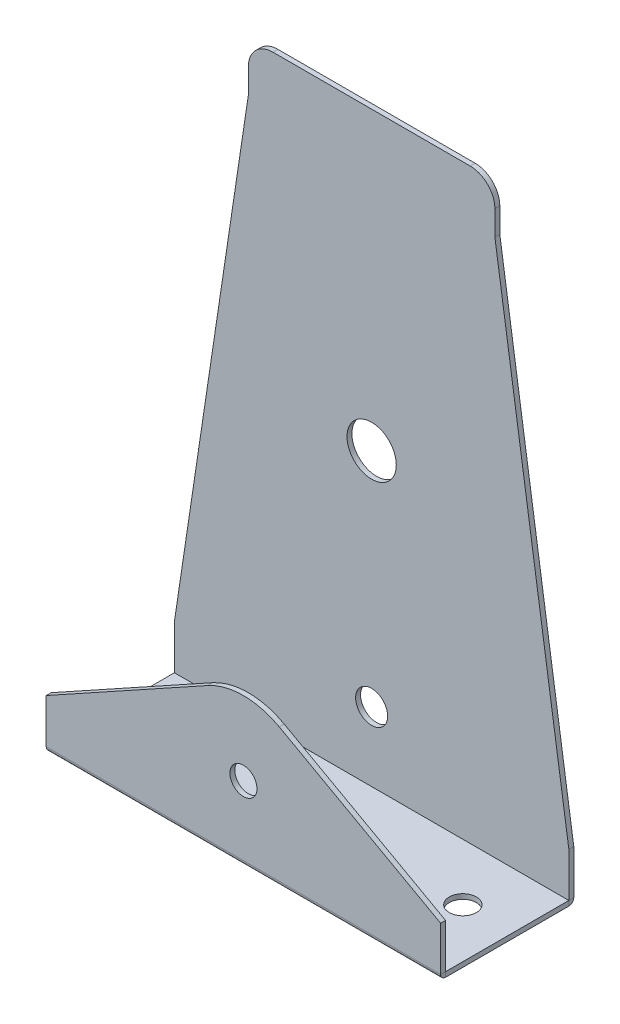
ISO-10303-21;
HEADER;
FILE_DESCRIPTION(('STEP AP214'),'2;1');
FILE_NAME('part.step','',(''),(''),'','','');
FILE_SCHEMA(('AUTOMOTIVE_DESIGN { 1 0 10303 214 1 1 1 1 }'));
ENDSEC;
DATA;
#1=APPLICATION_CONTEXT('core data for automotive mechanical design processes');
#2=APPLICATION_PROTOCOL_DEFINITION('international standard','automotive_design',2000,#1);
#3=PRODUCT_CONTEXT('',#1,'mechanical');
#4=PRODUCT('Part','Part','',(#3));
#5=PRODUCT_RELATED_PRODUCT_CATEGORY('part','',(#4));
#6=PRODUCT_DEFINITION_FORMATION('','',#4);
#7=PRODUCT_DEFINITION_CONTEXT('part definition',#1,'design');
#8=PRODUCT_DEFINITION('design','',#6,#7);
#9=PRODUCT_DEFINITION_SHAPE('','',#8);
#10=(LENGTH_UNIT() NAMED_UNIT(*) SI_UNIT(.MILLI.,.METRE.));
#11=(NAMED_UNIT(*) PLANE_ANGLE_UNIT() SI_UNIT($,.RADIAN.));
#12=(NAMED_UNIT(*) SI_UNIT($,.STERADIAN.) SOLID_ANGLE_UNIT());
#13=UNCERTAINTY_MEASURE_WITH_UNIT(LENGTH_MEASURE(1.E-05),#10,'distance_accuracy_value','');
#14=(GEOMETRIC_REPRESENTATION_CONTEXT(3) GLOBAL_UNCERTAINTY_ASSIGNED_CONTEXT((#13)) GLOBAL_UNIT_ASSIGNED_CONTEXT((#10,
#11,#12)) REPRESENTATION_CONTEXT('',''));
#15=CARTESIAN_POINT('',(0.,0.,0.));
#16=DIRECTION('',(0.,0.,1.));
#17=DIRECTION('',(1.,0.,0.));
#18=AXIS2_PLACEMENT_3D('',#15,#16,#17);
#19=CARTESIAN_POINT('',(-40.,39.0000000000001,35.0000272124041));
#20=DIRECTION('',(1.,0.,0.));
#21=DIRECTION('',(0.,-1.,0.));
#22=AXIS2_PLACEMENT_3D('',#19,#20,#21);
#23=PLANE('',#22);
#24=DIRECTION('',(0.,0.,1.));
#25=VECTOR('',#24,1.);
#26=CARTESIAN_POINT('',(-40.,39.0000000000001,35.0000272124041));
#27=LINE('',#26,#25);
#28=CARTESIAN_POINT('',(-40.,39.,1.0001));
#29=VERTEX_POINT('',#28);
#30=CARTESIAN_POINT('',(-40.,39.0000000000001,25.9999272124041));
#31=VERTEX_POINT('',#30);
#32=EDGE_CURVE('E43',#29,#31,#27,.T.);
#33=ORIENTED_EDGE('',*,*,#32,.F.);
#34=DIRECTION('',(0.,-1.,0.));
#35=VECTOR('',#34,1.);
#36=CARTESIAN_POINT('',(-40.,39.0000000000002,1.0001));
#37=LINE('',#36,#35);
#38=CARTESIAN_POINT('',(-40.,38.,1.0001));
#39=VERTEX_POINT('',#38);
#40=EDGE_CURVE('E12',#29,#39,#37,.T.);
#41=ORIENTED_EDGE('',*,*,#40,.T.);
#42=DIRECTION('',(0.,0.,1.));
#43=VECTOR('',#42,1.);
#44=CARTESIAN_POINT('',(-40.,38.0000000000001,35.0000272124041));
#45=LINE('',#44,#43);
#46=CARTESIAN_POINT('',(-40.,38.0000000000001,25.9999272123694));
#47=VERTEX_POINT('',#46);
#48=EDGE_CURVE('E56',#39,#47,#45,.T.);
#49=ORIENTED_EDGE('',*,*,#48,.T.);
#50=DIRECTION('',(0.,1.,0.));
#51=VECTOR('',#50,1.);
#52=CARTESIAN_POINT('',(-40.,39.0000000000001,25.9999272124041));
#53=LINE('',#52,#51);
#54=EDGE_CURVE('E376',#47,#31,#53,.T.);
#55=ORIENTED_EDGE('',*,*,#54,.T.);
#56=EDGE_LOOP('',(#33,#41,#49,#55));
#57=FACE_BOUND('',#56,.T.);
#58=ADVANCED_FACE('F40',(#57),#23,.F.);
#59=CARTESIAN_POINT('',(40.,39.0000000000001,35.0000272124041));
#60=DIRECTION('',(-1.,0.,0.));
#61=DIRECTION('',(0.,1.,0.));
#62=AXIS2_PLACEMENT_3D('',#59,#60,#61);
#63=PLANE('',#62);
#64=DIRECTION('',(0.,0.,-1.));
#65=VECTOR('',#64,1.);
#66=CARTESIAN_POINT('',(40.,38.0000000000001,35.0000272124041));
#67=LINE('',#66,#65);
#68=CARTESIAN_POINT('',(40.,38.0000000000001,25.9999272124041));
#69=VERTEX_POINT('',#68);
#70=CARTESIAN_POINT('',(40.,38.,1.0001));
#71=VERTEX_POINT('',#70);
#72=EDGE_CURVE('E63',#69,#71,#67,.T.);
#73=ORIENTED_EDGE('',*,*,#72,.T.);
#74=DIRECTION('',(0.,1.,0.));
#75=VECTOR('',#74,1.);
#76=CARTESIAN_POINT('',(40.,39.0000000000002,1.0001));
#77=LINE('',#76,#75);
#78=CARTESIAN_POINT('',(40.,39.,1.0001));
#79=VERTEX_POINT('',#78);
#80=EDGE_CURVE('E178',#71,#79,#77,.T.);
#81=ORIENTED_EDGE('',*,*,#80,.T.);
#82=DIRECTION('',(0.,0.,-1.));
#83=VECTOR('',#82,1.);
#84=CARTESIAN_POINT('',(40.,39.0000000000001,35.0000272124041));
#85=LINE('',#84,#83);
#86=CARTESIAN_POINT('',(40.,39.0000000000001,25.9999272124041));
#87=VERTEX_POINT('',#86);
#88=EDGE_CURVE('E181',#87,#79,#85,.T.);
#89=ORIENTED_EDGE('',*,*,#88,.F.);
#90=DIRECTION('',(0.,-1.,0.));
#91=VECTOR('',#90,1.);
#92=CARTESIAN_POINT('',(40.,39.0000000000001,25.9999272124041));
#93=LINE('',#92,#91);
#94=EDGE_CURVE('E204',#87,#69,#93,.T.);
#95=ORIENTED_EDGE('',*,*,#94,.T.);
#96=EDGE_LOOP('',(#73,#81,#89,#95));
#97=FACE_BOUND('',#96,.T.);
#98=ADVANCED_FACE('F180',(#97),#63,.F.);
#99=CARTESIAN_POINT('',(0.,38.0000000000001,40.0000272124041));
#100=DIRECTION('',(0.,1.,0.));
#101=DIRECTION('',(1.,0.,0.));
#102=AXIS2_PLACEMENT_3D('',#99,#100,#101);
#103=PLANE('',#102);
#104=CARTESIAN_POINT('',(-30.,38.,12.5000272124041));
#105=DIRECTION('',(0.,1.,0.));
#106=DIRECTION('',(1.,0.,0.));
#107=AXIS2_PLACEMENT_3D('',#104,#105,#106);
#108=CIRCLE('',#107,2.75);
#109=CARTESIAN_POINT('',(-27.25,38.,12.5000272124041));
#110=VERTEX_POINT('',#109);
#111=EDGE_CURVE('E367',#110,#110,#108,.T.);
#112=ORIENTED_EDGE('',*,*,#111,.T.);
#113=EDGE_LOOP('',(#112));
#114=FACE_BOUND('',#113,.T.);
#115=CARTESIAN_POINT('',(30.,38.,12.5000272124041));
#116=DIRECTION('',(0.,1.,0.));
#117=DIRECTION('',(1.,0.,0.));
#118=AXIS2_PLACEMENT_3D('',#115,#116,#117);
#119=CIRCLE('',#118,2.74999999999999);
#120=CARTESIAN_POINT('',(32.75,38.,12.5000272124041));
#121=VERTEX_POINT('',#120);
#122=EDGE_CURVE('E360',#121,#121,#119,.T.);
#123=ORIENTED_EDGE('',*,*,#122,.T.);
#124=EDGE_LOOP('',(#123));
#125=FACE_BOUND('',#124,.T.);
#126=ORIENTED_EDGE('',*,*,#48,.F.);
#127=DIRECTION('',(1.,0.,0.));
#128=VECTOR('',#127,1.);
#129=CARTESIAN_POINT('',(0.,38.,1.0001));
#130=LINE('',#129,#128);
#131=EDGE_CURVE('E48',#39,#71,#130,.T.);
#132=ORIENTED_EDGE('',*,*,#131,.T.);
#133=ORIENTED_EDGE('',*,*,#72,.F.);
#134=DIRECTION('',(-1.,0.,0.));
#135=VECTOR('',#134,1.);
#136=CARTESIAN_POINT('',(0.,38.0000000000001,25.9999272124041));
#137=LINE('',#136,#135);
#138=EDGE_CURVE('E379',#69,#47,#137,.T.);
#139=ORIENTED_EDGE('',*,*,#138,.T.);
#140=EDGE_LOOP('',(#126,#132,#133,#139));
#141=FACE_BOUND('',#140,.T.);
#142=ADVANCED_FACE('F388',(#114,#125,#141),#103,.F.);
#143=CARTESIAN_POINT('',(0.,39.0000000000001,40.0000272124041));
#144=DIRECTION('',(0.,1.,0.));
#145=DIRECTION('',(1.,0.,0.));
#146=AXIS2_PLACEMENT_3D('',#143,#144,#145);
#147=PLANE('',#146);
#148=DIRECTION('',(1.,0.,0.));
#149=VECTOR('',#148,1.);
#150=CARTESIAN_POINT('',(0.,39.,1.0001));
#151=LINE('',#150,#149);
#152=EDGE_CURVE('E186',#29,#79,#151,.T.);
#153=ORIENTED_EDGE('',*,*,#152,.F.);
#154=ORIENTED_EDGE('',*,*,#32,.T.);
#155=DIRECTION('',(-1.,0.,0.));
#156=VECTOR('',#155,1.);
#157=CARTESIAN_POINT('',(0.,39.0000000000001,25.9999272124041));
#158=LINE('',#157,#156);
#159=EDGE_CURVE('E195',#87,#31,#158,.T.);
#160=ORIENTED_EDGE('',*,*,#159,.F.);
#161=ORIENTED_EDGE('',*,*,#88,.T.);
#162=EDGE_LOOP('',(#153,#154,#160,#161));
#163=FACE_BOUND('',#162,.T.);
#164=CARTESIAN_POINT('',(30.,39.,12.5000272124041));
#165=DIRECTION('',(0.,1.,0.));
#166=DIRECTION('',(1.,0.,0.));
#167=AXIS2_PLACEMENT_3D('',#164,#165,#166);
#168=CIRCLE('',#167,2.74999999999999);
#169=CARTESIAN_POINT('',(32.75,39.,12.5000272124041));
#170=VERTEX_POINT('',#169);
#171=EDGE_CURVE('E364',#170,#170,#168,.T.);
#172=ORIENTED_EDGE('',*,*,#171,.F.);
#173=EDGE_LOOP('',(#172));
#174=FACE_BOUND('',#173,.T.);
#175=CARTESIAN_POINT('',(-30.,39.,12.500027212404));
#176=DIRECTION('',(0.,1.,0.));
#177=DIRECTION('',(1.,0.,0.));
#178=AXIS2_PLACEMENT_3D('',#175,#176,#177);
#179=CIRCLE('',#178,2.75);
#180=CARTESIAN_POINT('',(-27.25,39.,12.500027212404));
#181=VERTEX_POINT('',#180);
#182=EDGE_CURVE('E370',#181,#181,#179,.T.);
#183=ORIENTED_EDGE('',*,*,#182,.F.);
#184=EDGE_LOOP('',(#183));
#185=FACE_BOUND('',#184,.T.);
#186=ADVANCED_FACE('F191',(#163,#174,#185),#147,.T.);
#187=CARTESIAN_POINT('',(-30.,39.,12.500027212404));
#188=DIRECTION('',(0.,-1.,0.));
#189=DIRECTION('',(-1.,0.,0.));
#190=AXIS2_PLACEMENT_3D('',#187,#188,#189);
#191=CYLINDRICAL_SURFACE('',#190,2.75);
#192=ORIENTED_EDGE('',*,*,#182,.T.);
#193=EDGE_LOOP('',(#192));
#194=FACE_BOUND('',#193,.T.);
#195=ORIENTED_EDGE('',*,*,#111,.F.);
#196=EDGE_LOOP('',(#195));
#197=FACE_BOUND('',#196,.T.);
#198=ADVANCED_FACE('F477',(#194,#197),#191,.F.);
#199=CARTESIAN_POINT('',(30.,39.,12.5000272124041));
#200=DIRECTION('',(0.,-1.,0.));
#201=DIRECTION('',(-1.,0.,0.));
#202=AXIS2_PLACEMENT_3D('',#199,#200,#201);
#203=CYLINDRICAL_SURFACE('',#202,2.74999999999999);
#204=ORIENTED_EDGE('',*,*,#171,.T.);
#205=EDGE_LOOP('',(#204));
#206=FACE_BOUND('',#205,.T.);
#207=ORIENTED_EDGE('',*,*,#122,.F.);
#208=EDGE_LOOP('',(#207));
#209=FACE_BOUND('',#208,.T.);
#210=ADVANCED_FACE('F480',(#206,#209),#203,.F.);
#211=CARTESIAN_POINT('',(40.,39.0001000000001,25.9999272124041));
#212=DIRECTION('',(-1.,0.,0.));
#213=DIRECTION('',(0.,1.,0.));
#214=AXIS2_PLACEMENT_3D('',#211,#212,#213);
#215=PLANE('',#214);
#216=DIRECTION('',(0.,0.,1.));
#217=VECTOR('',#216,1.);
#218=CARTESIAN_POINT('',(40.,39.0001000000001,26.000027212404));
#219=LINE('',#218,#217);
#220=CARTESIAN_POINT('',(40.,39.0001000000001,26.0000272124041));
#221=VERTEX_POINT('',#220);
#222=CARTESIAN_POINT('',(40.,39.0001000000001,27.0000272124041));
#223=VERTEX_POINT('',#222);
#224=EDGE_CURVE('E224',#221,#223,#219,.T.);
#225=ORIENTED_EDGE('',*,*,#224,.T.);
#226=CARTESIAN_POINT('',(40.,39.0001000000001,25.9999272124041));
#227=DIRECTION('',(1.,0.,0.));
#228=DIRECTION('',(0.,-1.,0.));
#229=AXIS2_PLACEMENT_3D('',#226,#227,#228);
#230=CIRCLE('',#229,1.0001);
#231=EDGE_CURVE('E303',#223,#69,#230,.T.);
#232=ORIENTED_EDGE('',*,*,#231,.T.);
#233=ORIENTED_EDGE('',*,*,#94,.F.);
#234=CARTESIAN_POINT('',(40.,39.0001000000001,25.9999272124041));
#235=DIRECTION('',(1.,0.,0.));
#236=DIRECTION('',(0.,-1.,0.));
#237=AXIS2_PLACEMENT_3D('',#234,#235,#236);
#238=CIRCLE('',#237,9.99999999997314E-05);
#239=EDGE_CURVE('E353',#221,#87,#238,.T.);
#240=ORIENTED_EDGE('',*,*,#239,.F.);
#241=EDGE_LOOP('',(#225,#232,#233,#240));
#242=FACE_BOUND('',#241,.T.);
#243=ADVANCED_FACE('F484',(#242),#215,.F.);
#244=CARTESIAN_POINT('',(-40.,39.0001000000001,25.9999272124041));
#245=DIRECTION('',(1.,0.,0.));
#246=DIRECTION('',(0.,-1.,0.));
#247=AXIS2_PLACEMENT_3D('',#244,#245,#246);
#248=PLANE('',#247);
#249=CARTESIAN_POINT('',(-40.,39.0001000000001,25.9999272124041));
#250=DIRECTION('',(1.,0.,0.));
#251=DIRECTION('',(0.,-1.,0.));
#252=AXIS2_PLACEMENT_3D('',#249,#250,#251);
#253=CIRCLE('',#252,1.0001);
#254=CARTESIAN_POINT('',(-40.,39.0001000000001,27.000027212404));
#255=VERTEX_POINT('',#254);
#256=EDGE_CURVE('E357',#47,#255,#253,.F.);
#257=ORIENTED_EDGE('',*,*,#256,.T.);
#258=DIRECTION('',(0.,0.,-1.));
#259=VECTOR('',#258,1.);
#260=CARTESIAN_POINT('',(-40.,39.0001000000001,26.000027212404));
#261=LINE('',#260,#259);
#262=CARTESIAN_POINT('',(-40.,39.0001000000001,26.0000272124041));
#263=VERTEX_POINT('',#262);
#264=EDGE_CURVE('E345',#255,#263,#261,.T.);
#265=ORIENTED_EDGE('',*,*,#264,.T.);
#266=CARTESIAN_POINT('',(-40.,39.0001000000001,25.9999272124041));
#267=DIRECTION('',(-1.,0.,0.));
#268=DIRECTION('',(0.,1.,0.));
#269=AXIS2_PLACEMENT_3D('',#266,#267,#268);
#270=CIRCLE('',#269,9.99999999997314E-05);
#271=EDGE_CURVE('E356',#31,#263,#270,.T.);
#272=ORIENTED_EDGE('',*,*,#271,.F.);
#273=ORIENTED_EDGE('',*,*,#54,.F.);
#274=EDGE_LOOP('',(#257,#265,#272,#273));
#275=FACE_BOUND('',#274,.T.);
#276=ADVANCED_FACE('F395',(#275),#248,.F.);
#277=CARTESIAN_POINT('',(-80.006249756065,39.0001000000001,25.9999272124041));
#278=DIRECTION('',(1.,0.,0.));
#279=DIRECTION('',(0.,-1.,0.));
#280=AXIS2_PLACEMENT_3D('',#277,#278,#279);
#281=CYLINDRICAL_SURFACE('',#280,0.0001);
#282=ORIENTED_EDGE('',*,*,#159,.T.);
#283=ORIENTED_EDGE('',*,*,#271,.T.);
#284=DIRECTION('',(-1.,0.,0.));
#285=VECTOR('',#284,1.);
#286=CARTESIAN_POINT('',(0.,39.0001000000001,26.0000272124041));
#287=LINE('',#286,#285);
#288=EDGE_CURVE('E321',#221,#263,#287,.T.);
#289=ORIENTED_EDGE('',*,*,#288,.F.);
#290=ORIENTED_EDGE('',*,*,#239,.T.);
#291=EDGE_LOOP('',(#282,#283,#289,#290));
#292=FACE_BOUND('',#291,.T.);
#293=ADVANCED_FACE('F488',(#292),#281,.F.);
#294=CARTESIAN_POINT('',(-80.006249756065,39.0001000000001,25.9999272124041));
#295=DIRECTION('',(1.,0.,0.));
#296=DIRECTION('',(0.,-1.,0.));
#297=AXIS2_PLACEMENT_3D('',#294,#295,#296);
#298=CYLINDRICAL_SURFACE('',#297,1.0001);
#299=ORIENTED_EDGE('',*,*,#138,.F.);
#300=ORIENTED_EDGE('',*,*,#231,.F.);
#301=DIRECTION('',(-1.,0.,0.));
#302=VECTOR('',#301,1.);
#303=CARTESIAN_POINT('',(0.,39.0001000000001,27.0000272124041));
#304=LINE('',#303,#302);
#305=EDGE_CURVE('E348',#223,#255,#304,.T.);
#306=ORIENTED_EDGE('',*,*,#305,.T.);
#307=ORIENTED_EDGE('',*,*,#256,.F.);
#308=EDGE_LOOP('',(#299,#300,#306,#307));
#309=FACE_BOUND('',#308,.T.);
#310=ADVANCED_FACE('F392',(#309),#298,.T.);
#311=CARTESIAN_POINT('',(40.,48.0000272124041,26.000027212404));
#312=DIRECTION('',(-0.484358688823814,-0.874869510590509,0.));
#313=DIRECTION('',(-0.874869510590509,0.484358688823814,0.));
#314=AXIS2_PLACEMENT_3D('',#311,#312,#313);
#315=PLANE('',#314);
#316=DIRECTION('',(0.874869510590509,-0.484358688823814,0.));
#317=VECTOR('',#316,1.);
#318=CARTESIAN_POINT('',(40.,48.0000272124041,27.000027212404));
#319=LINE('',#318,#317);
#320=CARTESIAN_POINT('',(7.2653803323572,66.1230698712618,27.0000272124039));
#321=VERTEX_POINT('',#320);
#322=CARTESIAN_POINT('',(40.,48.0000272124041,27.000027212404));
#323=VERTEX_POINT('',#322);
#324=EDGE_CURVE('E343',#321,#323,#319,.T.);
#325=ORIENTED_EDGE('',*,*,#324,.T.);
#326=DIRECTION('',(0.,0.,1.));
#327=VECTOR('',#326,1.);
#328=CARTESIAN_POINT('',(40.,48.0000272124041,26.000027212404));
#329=LINE('',#328,#327);
#330=CARTESIAN_POINT('',(40.,48.0000272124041,26.000027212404));
#331=VERTEX_POINT('',#330);
#332=EDGE_CURVE('E304',#331,#323,#329,.T.);
#333=ORIENTED_EDGE('',*,*,#332,.F.);
#334=DIRECTION('',(0.874869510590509,-0.484358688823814,0.));
#335=VECTOR('',#334,1.);
#336=CARTESIAN_POINT('',(40.,48.0000272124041,26.000027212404));
#337=LINE('',#336,#335);
#338=CARTESIAN_POINT('',(7.2653803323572,66.1230698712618,26.0000272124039));
#339=VERTEX_POINT('',#338);
#340=EDGE_CURVE('E312',#339,#331,#337,.T.);
#341=ORIENTED_EDGE('',*,*,#340,.F.);
#342=DIRECTION('',(0.,0.,1.));
#343=VECTOR('',#342,1.);
#344=CARTESIAN_POINT('',(7.2653803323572,66.1230698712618,26.0000272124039));
#345=LINE('',#344,#343);
#346=EDGE_CURVE('E340',#339,#321,#345,.T.);
#347=ORIENTED_EDGE('',*,*,#346,.T.);
#348=EDGE_LOOP('',(#325,#333,#341,#347));
#349=FACE_BOUND('',#348,.T.);
#350=ADVANCED_FACE('F494',(#349),#315,.F.);
#351=CARTESIAN_POINT('',(0.,53.0000272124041,26.000027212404));
#352=DIRECTION('',(0.,0.,1.));
#353=DIRECTION('',(-1.,0.,0.));
#354=AXIS2_PLACEMENT_3D('',#351,#352,#353);
#355=CYLINDRICAL_SURFACE('',#354,15.);
#356=CARTESIAN_POINT('',(0.,53.0000272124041,27.000027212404));
#357=DIRECTION('',(0.,0.,-1.));
#358=DIRECTION('',(1.,0.,0.));
#359=AXIS2_PLACEMENT_3D('',#356,#357,#358);
#360=CIRCLE('',#359,15.);
#361=CARTESIAN_POINT('',(-7.2653803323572,66.1230698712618,27.0000272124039));
#362=VERTEX_POINT('',#361);
#363=EDGE_CURVE('E337',#362,#321,#360,.T.);
#364=ORIENTED_EDGE('',*,*,#363,.T.);
#365=ORIENTED_EDGE('',*,*,#346,.F.);
#366=CARTESIAN_POINT('',(0.,53.0000272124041,26.000027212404));
#367=DIRECTION('',(0.,0.,-1.));
#368=DIRECTION('',(1.,0.,0.));
#369=AXIS2_PLACEMENT_3D('',#366,#367,#368);
#370=CIRCLE('',#369,15.);
#371=CARTESIAN_POINT('',(-7.2653803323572,66.1230698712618,26.0000272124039));
#372=VERTEX_POINT('',#371);
#373=EDGE_CURVE('E314',#372,#339,#370,.T.);
#374=ORIENTED_EDGE('',*,*,#373,.F.);
#375=DIRECTION('',(0.,0.,1.));
#376=VECTOR('',#375,1.);
#377=CARTESIAN_POINT('',(-7.2653803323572,66.1230698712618,26.0000272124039));
#378=LINE('',#377,#376);
#379=EDGE_CURVE('E334',#372,#362,#378,.T.);
#380=ORIENTED_EDGE('',*,*,#379,.T.);
#381=EDGE_LOOP('',(#364,#365,#374,#380));
#382=FACE_BOUND('',#381,.T.);
#383=ADVANCED_FACE('F520',(#382),#355,.T.);
#384=CARTESIAN_POINT('',(-40.,48.0000272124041,26.000027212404));
#385=DIRECTION('',(0.484358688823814,-0.874869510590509,0.));
#386=DIRECTION('',(-0.874869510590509,-0.484358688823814,0.));
#387=AXIS2_PLACEMENT_3D('',#384,#385,#386);
#388=PLANE('',#387);
#389=DIRECTION('',(0.874869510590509,0.484358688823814,0.));
#390=VECTOR('',#389,1.);
#391=CARTESIAN_POINT('',(-40.,48.0000272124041,27.000027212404));
#392=LINE('',#391,#390);
#393=CARTESIAN_POINT('',(-40.,48.0000272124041,27.000027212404));
#394=VERTEX_POINT('',#393);
#395=EDGE_CURVE('E332',#394,#362,#392,.T.);
#396=ORIENTED_EDGE('',*,*,#395,.T.);
#397=ORIENTED_EDGE('',*,*,#379,.F.);
#398=DIRECTION('',(0.874869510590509,0.484358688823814,0.));
#399=VECTOR('',#398,1.);
#400=CARTESIAN_POINT('',(-40.,48.0000272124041,26.000027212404));
#401=LINE('',#400,#399);
#402=CARTESIAN_POINT('',(-40.,48.0000272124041,26.000027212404));
#403=VERTEX_POINT('',#402);
#404=EDGE_CURVE('E317',#403,#372,#401,.T.);
#405=ORIENTED_EDGE('',*,*,#404,.F.);
#406=DIRECTION('',(0.,0.,1.));
#407=VECTOR('',#406,1.);
#408=CARTESIAN_POINT('',(-40.,48.0000272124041,26.000027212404));
#409=LINE('',#408,#407);
#410=EDGE_CURVE('E329',#403,#394,#409,.T.);
#411=ORIENTED_EDGE('',*,*,#410,.T.);
#412=EDGE_LOOP('',(#396,#397,#405,#411));
#413=FACE_BOUND('',#412,.T.);
#414=ADVANCED_FACE('F516',(#413),#388,.F.);
#415=CARTESIAN_POINT('',(0.,53.0000272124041,26.000027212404));
#416=DIRECTION('',(0.,0.,1.));
#417=DIRECTION('',(-1.,0.,0.));
#418=AXIS2_PLACEMENT_3D('',#415,#416,#417);
#419=CYLINDRICAL_SURFACE('',#418,2.75);
#420=CARTESIAN_POINT('',(0.,53.0000272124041,26.000027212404));
#421=DIRECTION('',(0.,0.,-1.));
#422=DIRECTION('',(1.,0.,0.));
#423=AXIS2_PLACEMENT_3D('',#420,#421,#422);
#424=CIRCLE('',#423,2.75);
#425=CARTESIAN_POINT('',(2.75,53.0000272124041,26.000027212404));
#426=VERTEX_POINT('',#425);
#427=EDGE_CURVE('E326',#426,#426,#424,.T.);
#428=ORIENTED_EDGE('',*,*,#427,.T.);
#429=EDGE_LOOP('',(#428));
#430=FACE_BOUND('',#429,.T.);
#431=CARTESIAN_POINT('',(0.,53.0000272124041,27.000027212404));
#432=DIRECTION('',(0.,0.,-1.));
#433=DIRECTION('',(1.,0.,0.));
#434=AXIS2_PLACEMENT_3D('',#431,#432,#433);
#435=CIRCLE('',#434,2.75);
#436=CARTESIAN_POINT('',(2.75,53.0000272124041,27.000027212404));
#437=VERTEX_POINT('',#436);
#438=EDGE_CURVE('E307',#437,#437,#435,.T.);
#439=ORIENTED_EDGE('',*,*,#438,.F.);
#440=EDGE_LOOP('',(#439));
#441=FACE_BOUND('',#440,.T.);
#442=ADVANCED_FACE('F512',(#430,#441),#419,.F.);
#443=CARTESIAN_POINT('',(0.,53.0000272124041,26.000027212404));
#444=DIRECTION('',(0.,0.,-1.));
#445=DIRECTION('',(1.,0.,0.));
#446=AXIS2_PLACEMENT_3D('',#443,#444,#445);
#447=PLANE('',#446);
#448=ORIENTED_EDGE('',*,*,#427,.F.);
#449=EDGE_LOOP('',(#448));
#450=FACE_BOUND('',#449,.T.);
#451=DIRECTION('',(0.,-1.,0.));
#452=VECTOR('',#451,1.);
#453=CARTESIAN_POINT('',(40.,48.0000272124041,26.000027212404));
#454=LINE('',#453,#452);
#455=EDGE_CURVE('E323',#331,#221,#454,.T.);
#456=ORIENTED_EDGE('',*,*,#455,.T.);
#457=ORIENTED_EDGE('',*,*,#288,.T.);
#458=DIRECTION('',(0.,1.,0.));
#459=VECTOR('',#458,1.);
#460=CARTESIAN_POINT('',(-40.,48.0000272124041,26.000027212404));
#461=LINE('',#460,#459);
#462=EDGE_CURVE('E319',#263,#403,#461,.T.);
#463=ORIENTED_EDGE('',*,*,#462,.T.);
#464=ORIENTED_EDGE('',*,*,#404,.T.);
#465=ORIENTED_EDGE('',*,*,#373,.T.);
#466=ORIENTED_EDGE('',*,*,#340,.T.);
#467=EDGE_LOOP('',(#456,#457,#463,#464,#465,#466));
#468=FACE_BOUND('',#467,.T.);
#469=ADVANCED_FACE('F508',(#450,#468),#447,.T.);
#470=CARTESIAN_POINT('',(-40.,48.0000272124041,26.000027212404));
#471=DIRECTION('',(1.,0.,0.));
#472=DIRECTION('',(0.,0.,1.));
#473=AXIS2_PLACEMENT_3D('',#470,#471,#472);
#474=PLANE('',#473);
#475=ORIENTED_EDGE('',*,*,#264,.F.);
#476=DIRECTION('',(0.,1.,0.));
#477=VECTOR('',#476,1.);
#478=CARTESIAN_POINT('',(-40.,48.0000272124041,27.000027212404));
#479=LINE('',#478,#477);
#480=EDGE_CURVE('E310',#255,#394,#479,.T.);
#481=ORIENTED_EDGE('',*,*,#480,.T.);
#482=ORIENTED_EDGE('',*,*,#410,.F.);
#483=ORIENTED_EDGE('',*,*,#462,.F.);
#484=EDGE_LOOP('',(#475,#481,#482,#483));
#485=FACE_BOUND('',#484,.T.);
#486=ADVANCED_FACE('F504',(#485),#474,.F.);
#487=CARTESIAN_POINT('',(0.,53.0000272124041,27.000027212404));
#488=DIRECTION('',(0.,0.,-1.));
#489=DIRECTION('',(1.,0.,0.));
#490=AXIS2_PLACEMENT_3D('',#487,#488,#489);
#491=PLANE('',#490);
#492=ORIENTED_EDGE('',*,*,#305,.F.);
#493=DIRECTION('',(0.,-1.,0.));
#494=VECTOR('',#493,1.);
#495=CARTESIAN_POINT('',(40.,48.0000272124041,27.000027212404));
#496=LINE('',#495,#494);
#497=EDGE_CURVE('E301',#323,#223,#496,.T.);
#498=ORIENTED_EDGE('',*,*,#497,.F.);
#499=ORIENTED_EDGE('',*,*,#324,.F.);
#500=ORIENTED_EDGE('',*,*,#363,.F.);
#501=ORIENTED_EDGE('',*,*,#395,.F.);
#502=ORIENTED_EDGE('',*,*,#480,.F.);
#503=EDGE_LOOP('',(#492,#498,#499,#500,#501,#502));
#504=FACE_BOUND('',#503,.T.);
#505=ORIENTED_EDGE('',*,*,#438,.T.);
#506=EDGE_LOOP('',(#505));
#507=FACE_BOUND('',#506,.T.);
#508=ADVANCED_FACE('F500',(#504,#507),#491,.F.);
#509=CARTESIAN_POINT('',(40.,48.0000272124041,26.000027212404));
#510=DIRECTION('',(-1.,0.,0.));
#511=DIRECTION('',(0.,0.,-1.));
#512=AXIS2_PLACEMENT_3D('',#509,#510,#511);
#513=PLANE('',#512);
#514=ORIENTED_EDGE('',*,*,#224,.F.);
#515=ORIENTED_EDGE('',*,*,#455,.F.);
#516=ORIENTED_EDGE('',*,*,#332,.T.);
#517=ORIENTED_EDGE('',*,*,#497,.T.);
#518=EDGE_LOOP('',(#514,#515,#516,#517));
#519=FACE_BOUND('',#518,.T.);
#520=ADVANCED_FACE('F497',(#519),#513,.F.);
#521=CARTESIAN_POINT('',(-25.,148.,1.));
#522=DIRECTION('',(0.988936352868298,-0.148340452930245,0.));
#523=DIRECTION('',(0.148340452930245,0.988936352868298,0.));
#524=AXIS2_PLACEMENT_3D('',#521,#522,#523);
#525=PLANE('',#524);
#526=DIRECTION('',(-0.148340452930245,-0.988936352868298,0.));
#527=VECTOR('',#526,1.);
#528=CARTESIAN_POINT('',(-25.,148.,0.));
#529=LINE('',#528,#527);
#530=CARTESIAN_POINT('',(-25.,148.,0.));
#531=VERTEX_POINT('',#530);
#532=CARTESIAN_POINT('',(-40.,48.,0.));
#533=VERTEX_POINT('',#532);
#534=EDGE_CURVE('E296',#531,#533,#529,.T.);
#535=ORIENTED_EDGE('',*,*,#534,.T.);
#536=DIRECTION('',(0.,0.,-1.));
#537=VECTOR('',#536,1.);
#538=CARTESIAN_POINT('',(-40.,48.,1.));
#539=LINE('',#538,#537);
#540=CARTESIAN_POINT('',(-40.,48.,1.));
#541=VERTEX_POINT('',#540);
#542=EDGE_CURVE('E225',#541,#533,#539,.T.);
#543=ORIENTED_EDGE('',*,*,#542,.F.);
#544=DIRECTION('',(-0.148340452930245,-0.988936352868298,0.));
#545=VECTOR('',#544,1.);
#546=CARTESIAN_POINT('',(-25.,148.,1.));
#547=LINE('',#546,#545);
#548=CARTESIAN_POINT('',(-25.,148.,1.));
#549=VERTEX_POINT('',#548);
#550=EDGE_CURVE('E236',#549,#541,#547,.T.);
#551=ORIENTED_EDGE('',*,*,#550,.F.);
#552=DIRECTION('',(0.,0.,-1.));
#553=VECTOR('',#552,1.);
#554=CARTESIAN_POINT('',(-25.,148.,1.));
#555=LINE('',#554,#553);
#556=EDGE_CURVE('E293',#549,#531,#555,.T.);
#557=ORIENTED_EDGE('',*,*,#556,.T.);
#558=EDGE_LOOP('',(#535,#543,#551,#557));
#559=FACE_BOUND('',#558,.T.);
#560=ADVANCED_FACE('F426',(#559),#525,.F.);
#561=CARTESIAN_POINT('',(-25.,148.,1.));
#562=DIRECTION('',(1.,0.,0.));
#563=DIRECTION('',(0.,0.,-1.));
#564=AXIS2_PLACEMENT_3D('',#561,#562,#563);
#565=PLANE('',#564);
#566=DIRECTION('',(0.,-1.,0.));
#567=VECTOR('',#566,1.);
#568=CARTESIAN_POINT('',(-25.,148.,0.));
#569=LINE('',#568,#567);
#570=CARTESIAN_POINT('',(-25.,153.,0.));
#571=VERTEX_POINT('',#570);
#572=EDGE_CURVE('E291',#571,#531,#569,.T.);
#573=ORIENTED_EDGE('',*,*,#572,.T.);
#574=ORIENTED_EDGE('',*,*,#556,.F.);
#575=DIRECTION('',(0.,-1.,0.));
#576=VECTOR('',#575,1.);
#577=CARTESIAN_POINT('',(-25.,148.,1.));
#578=LINE('',#577,#576);
#579=CARTESIAN_POINT('',(-25.,153.,1.));
#580=VERTEX_POINT('',#579);
#581=EDGE_CURVE('E238',#580,#549,#578,.T.);
#582=ORIENTED_EDGE('',*,*,#581,.F.);
#583=DIRECTION('',(0.,0.,-1.));
#584=VECTOR('',#583,1.);
#585=CARTESIAN_POINT('',(-25.,153.,1.));
#586=LINE('',#585,#584);
#587=EDGE_CURVE('E288',#580,#571,#586,.T.);
#588=ORIENTED_EDGE('',*,*,#587,.T.);
#589=EDGE_LOOP('',(#573,#574,#582,#588));
#590=FACE_BOUND('',#589,.T.);
#591=ADVANCED_FACE('F432',(#590),#565,.F.);
#592=CARTESIAN_POINT('',(-20.,153.,1.));
#593=DIRECTION('',(0.,0.,-1.));
#594=DIRECTION('',(-1.,0.,0.));
#595=AXIS2_PLACEMENT_3D('',#592,#593,#594);
#596=CYLINDRICAL_SURFACE('',#595,5.);
#597=CARTESIAN_POINT('',(-20.,153.,0.));
#598=DIRECTION('',(0.,0.,1.));
#599=DIRECTION('',(-1.,0.,0.));
#600=AXIS2_PLACEMENT_3D('',#597,#598,#599);
#601=CIRCLE('',#600,5.);
#602=CARTESIAN_POINT('',(-20.,158.,0.));
#603=VERTEX_POINT('',#602);
#604=EDGE_CURVE('E286',#603,#571,#601,.T.);
#605=ORIENTED_EDGE('',*,*,#604,.T.);
#606=ORIENTED_EDGE('',*,*,#587,.F.);
#607=CARTESIAN_POINT('',(-20.,153.,1.));
#608=DIRECTION('',(0.,0.,1.));
#609=DIRECTION('',(-1.,0.,0.));
#610=AXIS2_PLACEMENT_3D('',#607,#608,#609);
#611=CIRCLE('',#610,5.);
#612=CARTESIAN_POINT('',(-20.,158.,1.));
#613=VERTEX_POINT('',#612);
#614=EDGE_CURVE('E240',#613,#580,#611,.T.);
#615=ORIENTED_EDGE('',*,*,#614,.F.);
#616=DIRECTION('',(0.,0.,-1.));
#617=VECTOR('',#616,1.);
#618=CARTESIAN_POINT('',(-20.,158.,1.));
#619=LINE('',#618,#617);
#620=EDGE_CURVE('E283',#613,#603,#619,.T.);
#621=ORIENTED_EDGE('',*,*,#620,.T.);
#622=EDGE_LOOP('',(#605,#606,#615,#621));
#623=FACE_BOUND('',#622,.T.);
#624=ADVANCED_FACE('F437',(#623),#596,.T.);
#625=CARTESIAN_POINT('',(-20.,158.,1.));
#626=DIRECTION('',(0.,-1.,0.));
#627=DIRECTION('',(0.,0.,-1.));
#628=AXIS2_PLACEMENT_3D('',#625,#626,#627);
#629=PLANE('',#628);
#630=DIRECTION('',(-1.,0.,0.));
#631=VECTOR('',#630,1.);
#632=CARTESIAN_POINT('',(-20.,158.,0.));
#633=LINE('',#632,#631);
#634=CARTESIAN_POINT('',(20.,158.,0.));
#635=VERTEX_POINT('',#634);
#636=EDGE_CURVE('E281',#635,#603,#633,.T.);
#637=ORIENTED_EDGE('',*,*,#636,.T.);
#638=ORIENTED_EDGE('',*,*,#620,.F.);
#639=DIRECTION('',(-1.,0.,0.));
#640=VECTOR('',#639,1.);
#641=CARTESIAN_POINT('',(-20.,158.,1.));
#642=LINE('',#641,#640);
#643=CARTESIAN_POINT('',(20.,158.,1.));
#644=VERTEX_POINT('',#643);
#645=EDGE_CURVE('E242',#644,#613,#642,.T.);
#646=ORIENTED_EDGE('',*,*,#645,.F.);
#647=DIRECTION('',(0.,0.,-1.));
#648=VECTOR('',#647,1.);
#649=CARTESIAN_POINT('',(20.,158.,1.));
#650=LINE('',#649,#648);
#651=EDGE_CURVE('E278',#644,#635,#650,.T.);
#652=ORIENTED_EDGE('',*,*,#651,.T.);
#653=EDGE_LOOP('',(#637,#638,#646,#652));
#654=FACE_BOUND('',#653,.T.);
#655=ADVANCED_FACE('F441',(#654),#629,.F.);
#656=CARTESIAN_POINT('',(20.,153.,1.));
#657=DIRECTION('',(0.,0.,-1.));
#658=DIRECTION('',(-1.,0.,0.));
#659=AXIS2_PLACEMENT_3D('',#656,#657,#658);
#660=CYLINDRICAL_SURFACE('',#659,5.);
#661=CARTESIAN_POINT('',(20.,153.,0.));
#662=DIRECTION('',(0.,0.,1.));
#663=DIRECTION('',(1.,0.,0.));
#664=AXIS2_PLACEMENT_3D('',#661,#662,#663);
#665=CIRCLE('',#664,5.);
#666=CARTESIAN_POINT('',(25.,153.,0.));
#667=VERTEX_POINT('',#666);
#668=EDGE_CURVE('E276',#667,#635,#665,.T.);
#669=ORIENTED_EDGE('',*,*,#668,.T.);
#670=ORIENTED_EDGE('',*,*,#651,.F.);
#671=CARTESIAN_POINT('',(20.,153.,1.));
#672=DIRECTION('',(0.,0.,1.));
#673=DIRECTION('',(1.,0.,0.));
#674=AXIS2_PLACEMENT_3D('',#671,#672,#673);
#675=CIRCLE('',#674,5.);
#676=CARTESIAN_POINT('',(25.,153.,1.));
#677=VERTEX_POINT('',#676);
#678=EDGE_CURVE('E244',#677,#644,#675,.T.);
#679=ORIENTED_EDGE('',*,*,#678,.F.);
#680=DIRECTION('',(0.,0.,-1.));
#681=VECTOR('',#680,1.);
#682=CARTESIAN_POINT('',(25.,153.,1.));
#683=LINE('',#682,#681);
#684=EDGE_CURVE('E273',#677,#667,#683,.T.);
#685=ORIENTED_EDGE('',*,*,#684,.T.);
#686=EDGE_LOOP('',(#669,#670,#679,#685));
#687=FACE_BOUND('',#686,.T.);
#688=ADVANCED_FACE('F445',(#687),#660,.T.);
#689=CARTESIAN_POINT('',(25.,148.,1.));
#690=DIRECTION('',(-1.,0.,0.));
#691=DIRECTION('',(0.,0.,1.));
#692=AXIS2_PLACEMENT_3D('',#689,#690,#691);
#693=PLANE('',#692);
#694=DIRECTION('',(0.,1.,0.));
#695=VECTOR('',#694,1.);
#696=CARTESIAN_POINT('',(25.,148.,0.));
#697=LINE('',#696,#695);
#698=CARTESIAN_POINT('',(25.,148.,0.));
#699=VERTEX_POINT('',#698);
#700=EDGE_CURVE('E271',#699,#667,#697,.T.);
#701=ORIENTED_EDGE('',*,*,#700,.T.);
#702=ORIENTED_EDGE('',*,*,#684,.F.);
#703=DIRECTION('',(0.,1.,0.));
#704=VECTOR('',#703,1.);
#705=CARTESIAN_POINT('',(25.,148.,1.));
#706=LINE('',#705,#704);
#707=CARTESIAN_POINT('',(25.,148.,1.));
#708=VERTEX_POINT('',#707);
#709=EDGE_CURVE('E246',#708,#677,#706,.T.);
#710=ORIENTED_EDGE('',*,*,#709,.F.);
#711=DIRECTION('',(0.,0.,-1.));
#712=VECTOR('',#711,1.);
#713=CARTESIAN_POINT('',(25.,148.,1.));
#714=LINE('',#713,#712);
#715=EDGE_CURVE('E268',#708,#699,#714,.T.);
#716=ORIENTED_EDGE('',*,*,#715,.T.);
#717=EDGE_LOOP('',(#701,#702,#710,#716));
#718=FACE_BOUND('',#717,.T.);
#719=ADVANCED_FACE('F450',(#718),#693,.F.);
#720=CARTESIAN_POINT('',(25.,148.,1.));
#721=DIRECTION('',(-0.988936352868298,-0.148340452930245,0.));
#722=DIRECTION('',(0.148340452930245,-0.988936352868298,0.));
#723=AXIS2_PLACEMENT_3D('',#720,#721,#722);
#724=PLANE('',#723);
#725=DIRECTION('',(-0.148340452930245,0.988936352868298,0.));
#726=VECTOR('',#725,1.);
#727=CARTESIAN_POINT('',(25.,148.,0.));
#728=LINE('',#727,#726);
#729=CARTESIAN_POINT('',(40.,48.,0.));
#730=VERTEX_POINT('',#729);
#731=EDGE_CURVE('E266',#730,#699,#728,.T.);
#732=ORIENTED_EDGE('',*,*,#731,.T.);
#733=ORIENTED_EDGE('',*,*,#715,.F.);
#734=DIRECTION('',(-0.148340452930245,0.988936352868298,0.));
#735=VECTOR('',#734,1.);
#736=CARTESIAN_POINT('',(25.,148.,1.));
#737=LINE('',#736,#735);
#738=CARTESIAN_POINT('',(40.,48.,1.));
#739=VERTEX_POINT('',#738);
#740=EDGE_CURVE('E248',#739,#708,#737,.T.);
#741=ORIENTED_EDGE('',*,*,#740,.F.);
#742=DIRECTION('',(0.,0.,-1.));
#743=VECTOR('',#742,1.);
#744=CARTESIAN_POINT('',(40.,48.,1.));
#745=LINE('',#744,#743);
#746=EDGE_CURVE('E263',#739,#730,#745,.T.);
#747=ORIENTED_EDGE('',*,*,#746,.T.);
#748=EDGE_LOOP('',(#732,#733,#741,#747));
#749=FACE_BOUND('',#748,.T.);
#750=ADVANCED_FACE('F453',(#749),#724,.F.);
#751=CARTESIAN_POINT('',(0.,98.,1.));
#752=DIRECTION('',(0.,0.,-1.));
#753=DIRECTION('',(-1.,0.,0.));
#754=AXIS2_PLACEMENT_3D('',#751,#752,#753);
#755=CYLINDRICAL_SURFACE('',#754,5.00000000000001);
#756=CARTESIAN_POINT('',(0.,98.,1.));
#757=DIRECTION('',(0.,0.,1.));
#758=DIRECTION('',(1.,0.,0.));
#759=AXIS2_PLACEMENT_3D('',#756,#757,#758);
#760=CIRCLE('',#759,5.00000000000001);
#761=CARTESIAN_POINT('',(5.00000000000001,98.,1.));
#762=VERTEX_POINT('',#761);
#763=EDGE_CURVE('E260',#762,#762,#760,.T.);
#764=ORIENTED_EDGE('',*,*,#763,.T.);
#765=EDGE_LOOP('',(#764));
#766=FACE_BOUND('',#765,.T.);
#767=CARTESIAN_POINT('',(0.,98.,0.));
#768=DIRECTION('',(0.,0.,1.));
#769=DIRECTION('',(1.,0.,0.));
#770=AXIS2_PLACEMENT_3D('',#767,#768,#769);
#771=CIRCLE('',#770,5.00000000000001);
#772=CARTESIAN_POINT('',(5.00000000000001,98.,0.));
#773=VERTEX_POINT('',#772);
#774=EDGE_CURVE('E228',#773,#773,#771,.T.);
#775=ORIENTED_EDGE('',*,*,#774,.F.);
#776=EDGE_LOOP('',(#775));
#777=FACE_BOUND('',#776,.T.);
#778=ADVANCED_FACE('F455',(#766,#777),#755,.F.);
#779=CARTESIAN_POINT('',(0.,53.,1.));
#780=DIRECTION('',(0.,0.,-1.));
#781=DIRECTION('',(-1.,0.,0.));
#782=AXIS2_PLACEMENT_3D('',#779,#780,#781);
#783=CYLINDRICAL_SURFACE('',#782,3.25);
#784=CARTESIAN_POINT('',(0.,53.,1.));
#785=DIRECTION('',(0.,0.,1.));
#786=DIRECTION('',(1.,0.,0.));
#787=AXIS2_PLACEMENT_3D('',#784,#785,#786);
#788=CIRCLE('',#787,3.25);
#789=CARTESIAN_POINT('',(3.25,53.,1.));
#790=VERTEX_POINT('',#789);
#791=EDGE_CURVE('E257',#790,#790,#788,.T.);
#792=ORIENTED_EDGE('',*,*,#791,.T.);
#793=EDGE_LOOP('',(#792));
#794=FACE_BOUND('',#793,.T.);
#795=CARTESIAN_POINT('',(0.,53.,0.));
#796=DIRECTION('',(0.,0.,1.));
#797=DIRECTION('',(1.,0.,0.));
#798=AXIS2_PLACEMENT_3D('',#795,#796,#797);
#799=CIRCLE('',#798,3.25);
#800=CARTESIAN_POINT('',(3.25,53.,0.));
#801=VERTEX_POINT('',#800);
#802=EDGE_CURVE('E231',#801,#801,#799,.T.);
#803=ORIENTED_EDGE('',*,*,#802,.F.);
#804=EDGE_LOOP('',(#803));
#805=FACE_BOUND('',#804,.T.);
#806=ADVANCED_FACE('F461',(#794,#805),#783,.F.);
#807=CARTESIAN_POINT('',(0.,0.,1.));
#808=DIRECTION('',(0.,0.,1.));
#809=DIRECTION('',(1.,0.,0.));
#810=AXIS2_PLACEMENT_3D('',#807,#808,#809);
#811=PLANE('',#810);
#812=ORIENTED_EDGE('',*,*,#791,.F.);
#813=EDGE_LOOP('',(#812));
#814=FACE_BOUND('',#813,.T.);
#815=ORIENTED_EDGE('',*,*,#763,.F.);
#816=EDGE_LOOP('',(#815));
#817=FACE_BOUND('',#816,.T.);
#818=DIRECTION('',(0.,-1.,0.));
#819=VECTOR('',#818,1.);
#820=CARTESIAN_POINT('',(-40.,5.,1.));
#821=LINE('',#820,#819);
#822=CARTESIAN_POINT('',(-40.,39.0001,1.));
#823=VERTEX_POINT('',#822);
#824=EDGE_CURVE('E255',#541,#823,#821,.T.);
#825=ORIENTED_EDGE('',*,*,#824,.T.);
#826=DIRECTION('',(1.,0.,0.));
#827=VECTOR('',#826,1.);
#828=CARTESIAN_POINT('',(0.,39.0001,1.));
#829=LINE('',#828,#827);
#830=CARTESIAN_POINT('',(40.,39.0001,1.));
#831=VERTEX_POINT('',#830);
#832=EDGE_CURVE('E252',#823,#831,#829,.T.);
#833=ORIENTED_EDGE('',*,*,#832,.T.);
#834=DIRECTION('',(0.,1.,0.));
#835=VECTOR('',#834,1.);
#836=CARTESIAN_POINT('',(40.,5.,1.));
#837=LINE('',#836,#835);
#838=EDGE_CURVE('E250',#831,#739,#837,.T.);
#839=ORIENTED_EDGE('',*,*,#838,.T.);
#840=ORIENTED_EDGE('',*,*,#740,.T.);
#841=ORIENTED_EDGE('',*,*,#709,.T.);
#842=ORIENTED_EDGE('',*,*,#678,.T.);
#843=ORIENTED_EDGE('',*,*,#645,.T.);
#844=ORIENTED_EDGE('',*,*,#614,.T.);
#845=ORIENTED_EDGE('',*,*,#581,.T.);
#846=ORIENTED_EDGE('',*,*,#550,.T.);
#847=EDGE_LOOP('',(#825,#833,#839,#840,#841,#842,#843,#844,#845,#846));
#848=FACE_BOUND('',#847,.T.);
#849=ADVANCED_FACE('F419',(#814,#817,#848),#811,.T.);
#850=CARTESIAN_POINT('',(40.,5.,1.));
#851=DIRECTION('',(-1.,0.,0.));
#852=DIRECTION('',(0.,0.,1.));
#853=AXIS2_PLACEMENT_3D('',#850,#851,#852);
#854=PLANE('',#853);
#855=DIRECTION('',(0.,0.,1.));
#856=VECTOR('',#855,1.);
#857=CARTESIAN_POINT('',(40.,39.0001,1.00000000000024));
#858=LINE('',#857,#856);
#859=CARTESIAN_POINT('',(40.,39.0001,0.));
#860=VERTEX_POINT('',#859);
#861=EDGE_CURVE('E209',#860,#831,#858,.T.);
#862=ORIENTED_EDGE('',*,*,#861,.F.);
#863=DIRECTION('',(0.,1.,0.));
#864=VECTOR('',#863,1.);
#865=CARTESIAN_POINT('',(40.,5.,0.));
#866=LINE('',#865,#864);
#867=EDGE_CURVE('E234',#860,#730,#866,.T.);
#868=ORIENTED_EDGE('',*,*,#867,.T.);
#869=ORIENTED_EDGE('',*,*,#746,.F.);
#870=ORIENTED_EDGE('',*,*,#838,.F.);
#871=EDGE_LOOP('',(#862,#868,#869,#870));
#872=FACE_BOUND('',#871,.T.);
#873=ADVANCED_FACE('F416',(#872),#854,.F.);
#874=CARTESIAN_POINT('',(0.,0.,0.));
#875=DIRECTION('',(0.,0.,1.));
#876=DIRECTION('',(1.,0.,0.));
#877=AXIS2_PLACEMENT_3D('',#874,#875,#876);
#878=PLANE('',#877);
#879=DIRECTION('',(1.,0.,0.));
#880=VECTOR('',#879,1.);
#881=CARTESIAN_POINT('',(0.,39.0001,0.));
#882=LINE('',#881,#880);
#883=CARTESIAN_POINT('',(-40.,39.0001,0.));
#884=VERTEX_POINT('',#883);
#885=EDGE_CURVE('E213',#884,#860,#882,.T.);
#886=ORIENTED_EDGE('',*,*,#885,.F.);
#887=DIRECTION('',(0.,-1.,0.));
#888=VECTOR('',#887,1.);
#889=CARTESIAN_POINT('',(-40.,5.,0.));
#890=LINE('',#889,#888);
#891=EDGE_CURVE('E222',#533,#884,#890,.T.);
#892=ORIENTED_EDGE('',*,*,#891,.F.);
#893=ORIENTED_EDGE('',*,*,#534,.F.);
#894=ORIENTED_EDGE('',*,*,#572,.F.);
#895=ORIENTED_EDGE('',*,*,#604,.F.);
#896=ORIENTED_EDGE('',*,*,#636,.F.);
#897=ORIENTED_EDGE('',*,*,#668,.F.);
#898=ORIENTED_EDGE('',*,*,#700,.F.);
#899=ORIENTED_EDGE('',*,*,#731,.F.);
#900=ORIENTED_EDGE('',*,*,#867,.F.);
#901=EDGE_LOOP('',(#886,#892,#893,#894,#895,#896,#897,#898,#899,#900));
#902=FACE_BOUND('',#901,.T.);
#903=ORIENTED_EDGE('',*,*,#802,.T.);
#904=EDGE_LOOP('',(#903));
#905=FACE_BOUND('',#904,.T.);
#906=ORIENTED_EDGE('',*,*,#774,.T.);
#907=EDGE_LOOP('',(#906));
#908=FACE_BOUND('',#907,.T.);
#909=ADVANCED_FACE('F409',(#902,#905,#908),#878,.F.);
#910=CARTESIAN_POINT('',(-40.,5.,1.));
#911=DIRECTION('',(1.,0.,0.));
#912=DIRECTION('',(0.,0.,-1.));
#913=AXIS2_PLACEMENT_3D('',#910,#911,#912);
#914=PLANE('',#913);
#915=DIRECTION('',(0.,0.,-1.));
#916=VECTOR('',#915,1.);
#917=CARTESIAN_POINT('',(-40.,39.0001,1.00000000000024));
#918=LINE('',#917,#916);
#919=EDGE_CURVE('E210',#823,#884,#918,.T.);
#920=ORIENTED_EDGE('',*,*,#919,.F.);
#921=ORIENTED_EDGE('',*,*,#824,.F.);
#922=ORIENTED_EDGE('',*,*,#542,.T.);
#923=ORIENTED_EDGE('',*,*,#891,.T.);
#924=EDGE_LOOP('',(#920,#921,#922,#923));
#925=FACE_BOUND('',#924,.T.);
#926=ADVANCED_FACE('F424',(#925),#914,.F.);
#927=CARTESIAN_POINT('',(-40.,39.0001,1.0001));
#928=DIRECTION('',(1.,0.,0.));
#929=DIRECTION('',(0.,0.,-1.));
#930=AXIS2_PLACEMENT_3D('',#927,#928,#929);
#931=PLANE('',#930);
#932=ORIENTED_EDGE('',*,*,#919,.T.);
#933=CARTESIAN_POINT('',(-40.,39.0001,1.0001));
#934=DIRECTION('',(1.,0.,0.));
#935=DIRECTION('',(0.,1.,0.));
#936=AXIS2_PLACEMENT_3D('',#933,#934,#935);
#937=CIRCLE('',#936,1.0001);
#938=EDGE_CURVE('E219',#884,#39,#937,.F.);
#939=ORIENTED_EDGE('',*,*,#938,.T.);
#940=ORIENTED_EDGE('',*,*,#40,.F.);
#941=CARTESIAN_POINT('',(-40.,39.0001,1.0001));
#942=DIRECTION('',(-1.,0.,0.));
#943=DIRECTION('',(0.,0.,1.));
#944=AXIS2_PLACEMENT_3D('',#941,#942,#943);
#945=CIRCLE('',#944,0.000100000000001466);
#946=EDGE_CURVE('E203',#823,#29,#945,.T.);
#947=ORIENTED_EDGE('',*,*,#946,.F.);
#948=EDGE_LOOP('',(#932,#939,#940,#947));
#949=FACE_BOUND('',#948,.T.);
#950=ADVANCED_FACE('F401',(#949),#931,.F.);
#951=CARTESIAN_POINT('',(40.,39.0001,1.0001));
#952=DIRECTION('',(-1.,0.,0.));
#953=DIRECTION('',(0.,0.,1.));
#954=AXIS2_PLACEMENT_3D('',#951,#952,#953);
#955=PLANE('',#954);
#956=ORIENTED_EDGE('',*,*,#80,.F.);
#957=CARTESIAN_POINT('',(40.,39.0001,1.0001));
#958=DIRECTION('',(1.,0.,0.));
#959=DIRECTION('',(0.,1.,0.));
#960=AXIS2_PLACEMENT_3D('',#957,#958,#959);
#961=CIRCLE('',#960,1.0001);
#962=EDGE_CURVE('E215',#71,#860,#961,.T.);
#963=ORIENTED_EDGE('',*,*,#962,.T.);
#964=ORIENTED_EDGE('',*,*,#861,.T.);
#965=CARTESIAN_POINT('',(40.,39.0001,1.0001));
#966=DIRECTION('',(1.,0.,0.));
#967=DIRECTION('',(0.,0.,-1.));
#968=AXIS2_PLACEMENT_3D('',#965,#966,#967);
#969=CIRCLE('',#968,9.99999999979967E-05);
#970=EDGE_CURVE('E201',#79,#831,#969,.T.);
#971=ORIENTED_EDGE('',*,*,#970,.F.);
#972=EDGE_LOOP('',(#956,#963,#964,#971));
#973=FACE_BOUND('',#972,.T.);
#974=ADVANCED_FACE('F207',(#973),#955,.F.);
#975=CARTESIAN_POINT('',(-80.006249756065,39.0001,1.0001));
#976=DIRECTION('',(1.,0.,0.));
#977=DIRECTION('',(0.,1.,0.));
#978=AXIS2_PLACEMENT_3D('',#975,#976,#977);
#979=CYLINDRICAL_SURFACE('',#978,0.0001);
#980=ORIENTED_EDGE('',*,*,#970,.T.);
#981=ORIENTED_EDGE('',*,*,#832,.F.);
#982=ORIENTED_EDGE('',*,*,#946,.T.);
#983=ORIENTED_EDGE('',*,*,#152,.T.);
#984=EDGE_LOOP('',(#980,#981,#982,#983));
#985=FACE_BOUND('',#984,.T.);
#986=ADVANCED_FACE('F199',(#985),#979,.F.);
#987=CARTESIAN_POINT('',(-80.006249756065,39.0001,1.0001));
#988=DIRECTION('',(1.,0.,0.));
#989=DIRECTION('',(0.,1.,0.));
#990=AXIS2_PLACEMENT_3D('',#987,#988,#989);
#991=CYLINDRICAL_SURFACE('',#990,1.0001);
#992=ORIENTED_EDGE('',*,*,#962,.F.);
#993=ORIENTED_EDGE('',*,*,#131,.F.);
#994=ORIENTED_EDGE('',*,*,#938,.F.);
#995=ORIENTED_EDGE('',*,*,#885,.T.);
#996=EDGE_LOOP('',(#992,#993,#994,#995));
#997=FACE_BOUND('',#996,.T.);
#998=ADVANCED_FACE('F405',(#997),#991,.T.);
#999=CLOSED_SHELL('',(#58,#98,#142,#186,#198,#210,#243,#276,#293,#310,#350,#383,#414,#442,#469,
#486,#508,#520,#560,#591,#624,#655,#688,#719,#750,#778,#806,#849,#873,#909,#926,#950,#974,#986,#998));
#1000=MANIFOLD_SOLID_BREP('B2',#999);
#1001=ADVANCED_BREP_SHAPE_REPRESENTATION('',(#18,#1000),#14);
#1002=SHAPE_DEFINITION_REPRESENTATION(#9,#1001);
ENDSEC;
END-ISO-10303-21;
